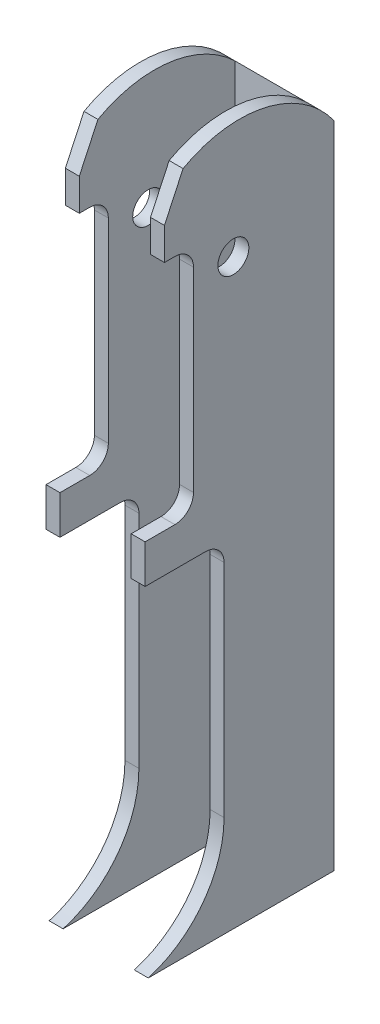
ISO-10303-21;
HEADER;
FILE_DESCRIPTION(('STEP AP214'),'2;1');
FILE_NAME('part.step','',(''),(''),'','','');
FILE_SCHEMA(('AUTOMOTIVE_DESIGN { 1 0 10303 214 1 1 1 1 }'));
ENDSEC;
DATA;
#1=APPLICATION_CONTEXT('core data for automotive mechanical design processes');
#2=APPLICATION_PROTOCOL_DEFINITION('international standard','automotive_design',2000,#1);
#3=PRODUCT_CONTEXT('',#1,'mechanical');
#4=PRODUCT('Part','Part','',(#3));
#5=PRODUCT_RELATED_PRODUCT_CATEGORY('part','',(#4));
#6=PRODUCT_DEFINITION_FORMATION('','',#4);
#7=PRODUCT_DEFINITION_CONTEXT('part definition',#1,'design');
#8=PRODUCT_DEFINITION('design','',#6,#7);
#9=PRODUCT_DEFINITION_SHAPE('','',#8);
#10=(LENGTH_UNIT() NAMED_UNIT(*) SI_UNIT(.MILLI.,.METRE.));
#11=(NAMED_UNIT(*) PLANE_ANGLE_UNIT() SI_UNIT($,.RADIAN.));
#12=(NAMED_UNIT(*) SI_UNIT($,.STERADIAN.) SOLID_ANGLE_UNIT());
#13=UNCERTAINTY_MEASURE_WITH_UNIT(LENGTH_MEASURE(1.E-05),#10,'distance_accuracy_value','');
#14=(GEOMETRIC_REPRESENTATION_CONTEXT(3) GLOBAL_UNCERTAINTY_ASSIGNED_CONTEXT((#13)) GLOBAL_UNIT_ASSIGNED_CONTEXT((#10,
#11,#12)) REPRESENTATION_CONTEXT('',''));
#15=CARTESIAN_POINT('',(0.,0.,0.));
#16=DIRECTION('',(0.,0.,1.));
#17=DIRECTION('',(1.,0.,0.));
#18=AXIS2_PLACEMENT_3D('',#15,#16,#17);
#19=CARTESIAN_POINT('',(0.,47.752,8.255));
#20=DIRECTION('',(-1.,0.,0.));
#21=DIRECTION('',(0.,0.,1.));
#22=AXIS2_PLACEMENT_3D('',#19,#20,#21);
#23=CYLINDRICAL_SURFACE('',#22,1.27);
#24=CARTESIAN_POINT('',(-1.143,47.752,8.255));
#25=DIRECTION('',(-1.,0.,0.));
#26=DIRECTION('',(0.,0.,1.));
#27=AXIS2_PLACEMENT_3D('',#24,#25,#26);
#28=CIRCLE('',#27,1.27);
#29=CARTESIAN_POINT('',(-1.143,47.752,9.525));
#30=VERTEX_POINT('',#29);
#31=EDGE_CURVE('E284',#30,#30,#28,.T.);
#32=ORIENTED_EDGE('',*,*,#31,.T.);
#33=EDGE_LOOP('',(#32));
#34=FACE_BOUND('',#33,.T.);
#35=CARTESIAN_POINT('',(0.,47.752,8.255));
#36=DIRECTION('',(-1.,0.,0.));
#37=DIRECTION('',(0.,0.,1.));
#38=AXIS2_PLACEMENT_3D('',#35,#36,#37);
#39=CIRCLE('',#38,1.27);
#40=CARTESIAN_POINT('',(0.,47.752,9.525));
#41=VERTEX_POINT('',#40);
#42=EDGE_CURVE('E542',#41,#41,#39,.T.);
#43=ORIENTED_EDGE('',*,*,#42,.F.);
#44=EDGE_LOOP('',(#43));
#45=FACE_BOUND('',#44,.T.);
#46=ADVANCED_FACE('F17',(#34,#45),#23,.F.);
#47=CARTESIAN_POINT('',(-8.128,50.165,13.9065));
#48=DIRECTION('',(0.,-1.,0.));
#49=DIRECTION('',(0.,0.,-1.));
#50=AXIS2_PLACEMENT_3D('',#47,#48,#49);
#51=PLANE('',#50);
#52=DIRECTION('',(0.,0.,-1.));
#53=VECTOR('',#52,1.);
#54=CARTESIAN_POINT('',(0.,50.165,7.747));
#55=LINE('',#54,#53);
#56=CARTESIAN_POINT('',(0.,50.165,13.9065));
#57=VERTEX_POINT('',#56);
#58=CARTESIAN_POINT('',(0.,50.165,13.04925));
#59=VERTEX_POINT('',#58);
#60=EDGE_CURVE('E212',#57,#59,#55,.T.);
#61=ORIENTED_EDGE('',*,*,#60,.F.);
#62=DIRECTION('',(1.,0.,0.));
#63=VECTOR('',#62,1.);
#64=CARTESIAN_POINT('',(-8.128,50.165,13.9065));
#65=LINE('',#64,#63);
#66=CARTESIAN_POINT('',(-1.143,50.165,13.9065));
#67=VERTEX_POINT('',#66);
#68=EDGE_CURVE('E248',#67,#57,#65,.T.);
#69=ORIENTED_EDGE('',*,*,#68,.F.);
#70=DIRECTION('',(0.,0.,-1.));
#71=VECTOR('',#70,1.);
#72=CARTESIAN_POINT('',(-1.143,50.165,7.747));
#73=LINE('',#72,#71);
#74=CARTESIAN_POINT('',(-1.143,50.165,13.04925));
#75=VERTEX_POINT('',#74);
#76=EDGE_CURVE('E281',#67,#75,#73,.T.);
#77=ORIENTED_EDGE('',*,*,#76,.T.);
#78=DIRECTION('',(-1.,0.,0.));
#79=VECTOR('',#78,1.);
#80=CARTESIAN_POINT('',(-8.128,50.165,13.04925));
#81=LINE('',#80,#79);
#82=EDGE_CURVE('E231',#75,#59,#81,.F.);
#83=ORIENTED_EDGE('',*,*,#82,.T.);
#84=EDGE_LOOP('',(#61,#69,#77,#83));
#85=FACE_BOUND('',#84,.T.);
#86=ADVANCED_FACE('F607',(#85),#51,.T.);
#87=CARTESIAN_POINT('',(-8.128,48.641,13.04925));
#88=DIRECTION('',(-1.,0.,0.));
#89=DIRECTION('',(0.,0.,1.));
#90=AXIS2_PLACEMENT_3D('',#87,#88,#89);
#91=CYLINDRICAL_SURFACE('',#90,1.524);
#92=DIRECTION('',(1.,0.,0.));
#93=VECTOR('',#92,1.);
#94=CARTESIAN_POINT('',(-8.128,48.641,11.52525));
#95=LINE('',#94,#93);
#96=CARTESIAN_POINT('',(0.,48.641,11.52525));
#97=VERTEX_POINT('',#96);
#98=CARTESIAN_POINT('',(-1.143,48.641,11.52525));
#99=VERTEX_POINT('',#98);
#100=EDGE_CURVE('E223',#97,#99,#95,.F.);
#101=ORIENTED_EDGE('',*,*,#100,.F.);
#102=CARTESIAN_POINT('',(0.,48.641,13.04925));
#103=DIRECTION('',(-1.,0.,0.));
#104=DIRECTION('',(0.,0.,1.));
#105=AXIS2_PLACEMENT_3D('',#102,#103,#104);
#106=CIRCLE('',#105,1.524);
#107=EDGE_CURVE('E21',#59,#97,#106,.T.);
#108=ORIENTED_EDGE('',*,*,#107,.F.);
#109=ORIENTED_EDGE('',*,*,#82,.F.);
#110=CARTESIAN_POINT('',(-1.143,48.641,13.04925));
#111=DIRECTION('',(-1.,0.,0.));
#112=DIRECTION('',(0.,0.,1.));
#113=AXIS2_PLACEMENT_3D('',#110,#111,#112);
#114=CIRCLE('',#113,1.524);
#115=EDGE_CURVE('E226',#75,#99,#114,.T.);
#116=ORIENTED_EDGE('',*,*,#115,.T.);
#117=EDGE_LOOP('',(#101,#108,#109,#116));
#118=FACE_BOUND('',#117,.T.);
#119=ADVANCED_FACE('F224',(#118),#91,.F.);
#120=CARTESIAN_POINT('',(-8.128,50.165,11.52525));
#121=DIRECTION('',(0.,0.,1.));
#122=DIRECTION('',(1.,0.,0.));
#123=AXIS2_PLACEMENT_3D('',#120,#121,#122);
#124=PLANE('',#123);
#125=DIRECTION('',(0.,1.,0.));
#126=VECTOR('',#125,1.);
#127=CARTESIAN_POINT('',(-1.143,47.752,11.52525));
#128=LINE('',#127,#126);
#129=CARTESIAN_POINT('',(-1.143,32.639,11.52525));
#130=VERTEX_POINT('',#129);
#131=EDGE_CURVE('E279',#99,#130,#128,.F.);
#132=ORIENTED_EDGE('',*,*,#131,.T.);
#133=DIRECTION('',(1.,0.,0.));
#134=VECTOR('',#133,1.);
#135=CARTESIAN_POINT('',(-8.128,32.639,11.52525));
#136=LINE('',#135,#134);
#137=CARTESIAN_POINT('',(0.,32.639,11.52525));
#138=VERTEX_POINT('',#137);
#139=EDGE_CURVE('E230',#130,#138,#136,.T.);
#140=ORIENTED_EDGE('',*,*,#139,.T.);
#141=DIRECTION('',(0.,1.,0.));
#142=VECTOR('',#141,1.);
#143=CARTESIAN_POINT('',(0.,47.752,11.52525));
#144=LINE('',#143,#142);
#145=EDGE_CURVE('E219',#97,#138,#144,.F.);
#146=ORIENTED_EDGE('',*,*,#145,.F.);
#147=ORIENTED_EDGE('',*,*,#100,.T.);
#148=EDGE_LOOP('',(#132,#140,#146,#147));
#149=FACE_BOUND('',#148,.T.);
#150=ADVANCED_FACE('F233',(#149),#124,.T.);
#151=CARTESIAN_POINT('',(-8.128,32.639,13.04925));
#152=DIRECTION('',(1.,0.,0.));
#153=DIRECTION('',(0.,0.,-1.));
#154=AXIS2_PLACEMENT_3D('',#151,#152,#153);
#155=CYLINDRICAL_SURFACE('',#154,1.524);
#156=DIRECTION('',(1.,0.,0.));
#157=VECTOR('',#156,1.);
#158=CARTESIAN_POINT('',(-8.128,31.115,13.04925));
#159=LINE('',#158,#157);
#160=CARTESIAN_POINT('',(-1.143,31.115,13.04925));
#161=VERTEX_POINT('',#160);
#162=CARTESIAN_POINT('',(0.,31.115,13.04925));
#163=VERTEX_POINT('',#162);
#164=EDGE_CURVE('E479',#161,#163,#159,.T.);
#165=ORIENTED_EDGE('',*,*,#164,.T.);
#166=CARTESIAN_POINT('',(0.,32.639,13.04925));
#167=DIRECTION('',(1.,0.,0.));
#168=DIRECTION('',(0.,0.,-1.));
#169=AXIS2_PLACEMENT_3D('',#166,#167,#168);
#170=CIRCLE('',#169,1.524);
#171=EDGE_CURVE('E235',#138,#163,#170,.F.);
#172=ORIENTED_EDGE('',*,*,#171,.F.);
#173=ORIENTED_EDGE('',*,*,#139,.F.);
#174=CARTESIAN_POINT('',(-1.143,32.639,13.04925));
#175=DIRECTION('',(1.,0.,0.));
#176=DIRECTION('',(0.,0.,-1.));
#177=AXIS2_PLACEMENT_3D('',#174,#175,#176);
#178=CIRCLE('',#177,1.524);
#179=EDGE_CURVE('E276',#130,#161,#178,.F.);
#180=ORIENTED_EDGE('',*,*,#179,.T.);
#181=EDGE_LOOP('',(#165,#172,#173,#180));
#182=FACE_BOUND('',#181,.T.);
#183=ADVANCED_FACE('F613',(#182),#155,.F.);
#184=CARTESIAN_POINT('',(-8.128,31.115,15.494));
#185=DIRECTION('',(0.,-1.,0.));
#186=DIRECTION('',(0.,0.,-1.));
#187=AXIS2_PLACEMENT_3D('',#184,#185,#186);
#188=PLANE('',#187);
#189=ORIENTED_EDGE('',*,*,#164,.F.);
#190=DIRECTION('',(0.,0.,-1.));
#191=VECTOR('',#190,1.);
#192=CARTESIAN_POINT('',(-1.143,31.115,7.747));
#193=LINE('',#192,#191);
#194=CARTESIAN_POINT('',(-1.143,31.115,15.494));
#195=VERTEX_POINT('',#194);
#196=EDGE_CURVE('E273',#161,#195,#193,.F.);
#197=ORIENTED_EDGE('',*,*,#196,.T.);
#198=DIRECTION('',(1.,0.,0.));
#199=VECTOR('',#198,1.);
#200=CARTESIAN_POINT('',(-8.128,31.115,15.494));
#201=LINE('',#200,#199);
#202=CARTESIAN_POINT('',(0.,31.115,15.494));
#203=VERTEX_POINT('',#202);
#204=EDGE_CURVE('E471',#203,#195,#201,.F.);
#205=ORIENTED_EDGE('',*,*,#204,.F.);
#206=DIRECTION('',(0.,0.,-1.));
#207=VECTOR('',#206,1.);
#208=CARTESIAN_POINT('',(0.,31.115,7.747));
#209=LINE('',#208,#207);
#210=EDGE_CURVE('E237',#163,#203,#209,.F.);
#211=ORIENTED_EDGE('',*,*,#210,.F.);
#212=EDGE_LOOP('',(#189,#197,#205,#211));
#213=FACE_BOUND('',#212,.T.);
#214=ADVANCED_FACE('F562',(#213),#188,.F.);
#215=CARTESIAN_POINT('',(-8.128,31.115,15.494));
#216=DIRECTION('',(0.,0.,1.));
#217=DIRECTION('',(1.,0.,0.));
#218=AXIS2_PLACEMENT_3D('',#215,#216,#217);
#219=PLANE('',#218);
#220=DIRECTION('',(1.,0.,0.));
#221=VECTOR('',#220,1.);
#222=CARTESIAN_POINT('',(-8.128,27.94,15.494));
#223=LINE('',#222,#221);
#224=CARTESIAN_POINT('',(0.,27.94,15.494));
#225=VERTEX_POINT('',#224);
#226=CARTESIAN_POINT('',(-1.143,27.94,15.494));
#227=VERTEX_POINT('',#226);
#228=EDGE_CURVE('E469',#225,#227,#223,.F.);
#229=ORIENTED_EDGE('',*,*,#228,.F.);
#230=DIRECTION('',(0.,1.,0.));
#231=VECTOR('',#230,1.);
#232=CARTESIAN_POINT('',(0.,47.752,15.494));
#233=LINE('',#232,#231);
#234=EDGE_CURVE('E489',#203,#225,#233,.F.);
#235=ORIENTED_EDGE('',*,*,#234,.F.);
#236=ORIENTED_EDGE('',*,*,#204,.T.);
#237=DIRECTION('',(0.,1.,0.));
#238=VECTOR('',#237,1.);
#239=CARTESIAN_POINT('',(-1.143,47.752,15.494));
#240=LINE('',#239,#238);
#241=EDGE_CURVE('E270',#195,#227,#240,.F.);
#242=ORIENTED_EDGE('',*,*,#241,.T.);
#243=EDGE_LOOP('',(#229,#235,#236,#242));
#244=FACE_BOUND('',#243,.T.);
#245=ADVANCED_FACE('F566',(#244),#219,.T.);
#246=CARTESIAN_POINT('',(-8.128,27.94,15.494));
#247=DIRECTION('',(0.,-1.,0.));
#248=DIRECTION('',(0.,0.,-1.));
#249=AXIS2_PLACEMENT_3D('',#246,#247,#248);
#250=PLANE('',#249);
#251=DIRECTION('',(0.,0.,-1.));
#252=VECTOR('',#251,1.);
#253=CARTESIAN_POINT('',(0.,27.94,7.747));
#254=LINE('',#253,#252);
#255=CARTESIAN_POINT('',(0.,27.94,10.541));
#256=VERTEX_POINT('',#255);
#257=EDGE_CURVE('E491',#225,#256,#254,.T.);
#258=ORIENTED_EDGE('',*,*,#257,.F.);
#259=ORIENTED_EDGE('',*,*,#228,.T.);
#260=DIRECTION('',(0.,0.,-1.));
#261=VECTOR('',#260,1.);
#262=CARTESIAN_POINT('',(-1.143,27.94,7.747));
#263=LINE('',#262,#261);
#264=CARTESIAN_POINT('',(-1.143,27.94,10.541));
#265=VERTEX_POINT('',#264);
#266=EDGE_CURVE('E267',#227,#265,#263,.T.);
#267=ORIENTED_EDGE('',*,*,#266,.T.);
#268=DIRECTION('',(-1.,0.,0.));
#269=VECTOR('',#268,1.);
#270=CARTESIAN_POINT('',(-8.128,27.94,10.541));
#271=LINE('',#270,#269);
#272=EDGE_CURVE('E466',#265,#256,#271,.F.);
#273=ORIENTED_EDGE('',*,*,#272,.T.);
#274=EDGE_LOOP('',(#258,#259,#267,#273));
#275=FACE_BOUND('',#274,.T.);
#276=ADVANCED_FACE('F569',(#275),#250,.T.);
#277=CARTESIAN_POINT('',(-8.128,26.416,10.541));
#278=DIRECTION('',(-1.,0.,0.));
#279=DIRECTION('',(0.,0.,1.));
#280=AXIS2_PLACEMENT_3D('',#277,#278,#279);
#281=CYLINDRICAL_SURFACE('',#280,1.524);
#282=DIRECTION('',(1.,0.,0.));
#283=VECTOR('',#282,1.);
#284=CARTESIAN_POINT('',(-8.128,26.416,9.017));
#285=LINE('',#284,#283);
#286=CARTESIAN_POINT('',(0.,26.416,9.017));
#287=VERTEX_POINT('',#286);
#288=CARTESIAN_POINT('',(-1.143,26.416,9.017));
#289=VERTEX_POINT('',#288);
#290=EDGE_CURVE('E464',#287,#289,#285,.F.);
#291=ORIENTED_EDGE('',*,*,#290,.F.);
#292=CARTESIAN_POINT('',(0.,26.416,10.541));
#293=DIRECTION('',(-1.,0.,0.));
#294=DIRECTION('',(0.,0.,1.));
#295=AXIS2_PLACEMENT_3D('',#292,#293,#294);
#296=CIRCLE('',#295,1.524);
#297=EDGE_CURVE('E549',#256,#287,#296,.T.);
#298=ORIENTED_EDGE('',*,*,#297,.F.);
#299=ORIENTED_EDGE('',*,*,#272,.F.);
#300=CARTESIAN_POINT('',(-1.143,26.416,10.541));
#301=DIRECTION('',(-1.,0.,0.));
#302=DIRECTION('',(0.,0.,1.));
#303=AXIS2_PLACEMENT_3D('',#300,#301,#302);
#304=CIRCLE('',#303,1.524);
#305=EDGE_CURVE('E266',#265,#289,#304,.T.);
#306=ORIENTED_EDGE('',*,*,#305,.T.);
#307=EDGE_LOOP('',(#291,#298,#299,#306));
#308=FACE_BOUND('',#307,.T.);
#309=ADVANCED_FACE('F572',(#308),#281,.F.);
#310=CARTESIAN_POINT('',(-8.128,27.94,9.017));
#311=DIRECTION('',(0.,0.,1.));
#312=DIRECTION('',(1.,0.,0.));
#313=AXIS2_PLACEMENT_3D('',#310,#311,#312);
#314=PLANE('',#313);
#315=DIRECTION('',(0.,1.,0.));
#316=VECTOR('',#315,1.);
#317=CARTESIAN_POINT('',(-1.143,47.752,9.017));
#318=LINE('',#317,#316);
#319=CARTESIAN_POINT('',(-1.143,8.29056,9.017));
#320=VERTEX_POINT('',#319);
#321=EDGE_CURVE('E263',#289,#320,#318,.F.);
#322=ORIENTED_EDGE('',*,*,#321,.T.);
#323=DIRECTION('',(1.,0.,0.));
#324=VECTOR('',#323,1.);
#325=CARTESIAN_POINT('',(-8.128,8.29056,9.017));
#326=LINE('',#325,#324);
#327=CARTESIAN_POINT('',(0.,8.29056,9.017));
#328=VERTEX_POINT('',#327);
#329=EDGE_CURVE('E461',#320,#328,#326,.T.);
#330=ORIENTED_EDGE('',*,*,#329,.T.);
#331=DIRECTION('',(0.,1.,0.));
#332=VECTOR('',#331,1.);
#333=CARTESIAN_POINT('',(0.,47.752,9.017));
#334=LINE('',#333,#332);
#335=EDGE_CURVE('E548',#287,#328,#334,.F.);
#336=ORIENTED_EDGE('',*,*,#335,.F.);
#337=ORIENTED_EDGE('',*,*,#290,.T.);
#338=EDGE_LOOP('',(#322,#330,#336,#337));
#339=FACE_BOUND('',#338,.T.);
#340=ADVANCED_FACE('F576',(#339),#314,.T.);
#341=CARTESIAN_POINT('',(-8.128,8.29056,17.653));
#342=DIRECTION('',(1.,0.,0.));
#343=DIRECTION('',(0.,0.,-1.));
#344=AXIS2_PLACEMENT_3D('',#341,#342,#343);
#345=CYLINDRICAL_SURFACE('',#344,8.636);
#346=DIRECTION('',(1.,0.,0.));
#347=VECTOR('',#346,1.);
#348=CARTESIAN_POINT('',(-8.128,0.,15.23492));
#349=LINE('',#348,#347);
#350=CARTESIAN_POINT('',(0.,0.,15.23492));
#351=VERTEX_POINT('',#350);
#352=CARTESIAN_POINT('',(-1.143,0.,15.23492));
#353=VERTEX_POINT('',#352);
#354=EDGE_CURVE('E452',#351,#353,#349,.F.);
#355=ORIENTED_EDGE('',*,*,#354,.F.);
#356=CARTESIAN_POINT('',(0.,8.29056,17.653));
#357=DIRECTION('',(1.,0.,0.));
#358=DIRECTION('',(0.,0.,-1.));
#359=AXIS2_PLACEMENT_3D('',#356,#357,#358);
#360=CIRCLE('',#359,8.636);
#361=EDGE_CURVE('E545',#328,#351,#360,.F.);
#362=ORIENTED_EDGE('',*,*,#361,.F.);
#363=ORIENTED_EDGE('',*,*,#329,.F.);
#364=CARTESIAN_POINT('',(-1.143,8.29056,17.653));
#365=DIRECTION('',(1.,0.,0.));
#366=DIRECTION('',(0.,0.,-1.));
#367=AXIS2_PLACEMENT_3D('',#364,#365,#366);
#368=CIRCLE('',#367,8.636);
#369=EDGE_CURVE('E260',#320,#353,#368,.F.);
#370=ORIENTED_EDGE('',*,*,#369,.T.);
#371=EDGE_LOOP('',(#355,#362,#363,#370));
#372=FACE_BOUND('',#371,.T.);
#373=ADVANCED_FACE('F713',(#372),#345,.F.);
#374=CARTESIAN_POINT('',(0.,52.8002499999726,13.9065000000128));
#375=DIRECTION('',(0.,-0.422618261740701,-0.906307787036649));
#376=DIRECTION('',(0.,0.906307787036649,-0.422618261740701));
#377=AXIS2_PLACEMENT_3D('',#374,#375,#376);
#378=PLANE('',#377);
#379=DIRECTION('',(0.,-0.906307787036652,0.422618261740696));
#380=VECTOR('',#379,1.);
#381=CARTESIAN_POINT('',(0.,56.0744823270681,12.3797003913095));
#382=LINE('',#381,#380);
#383=CARTESIAN_POINT('',(0.,56.0744823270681,12.3797003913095));
#384=VERTEX_POINT('',#383);
#385=CARTESIAN_POINT('',(0.,52.80025,13.9065));
#386=VERTEX_POINT('',#385);
#387=EDGE_CURVE('E246',#384,#386,#382,.T.);
#388=ORIENTED_EDGE('',*,*,#387,.F.);
#389=DIRECTION('',(1.,0.,0.));
#390=VECTOR('',#389,1.);
#391=CARTESIAN_POINT('',(0.,56.0744823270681,12.3797003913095));
#392=LINE('',#391,#390);
#393=CARTESIAN_POINT('',(-1.143,56.0744823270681,12.3797003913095));
#394=VERTEX_POINT('',#393);
#395=EDGE_CURVE('E449',#394,#384,#392,.T.);
#396=ORIENTED_EDGE('',*,*,#395,.F.);
#397=DIRECTION('',(0.,-0.906307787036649,0.422618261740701));
#398=VECTOR('',#397,1.);
#399=CARTESIAN_POINT('',(-1.143,56.0744823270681,12.3797003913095));
#400=LINE('',#399,#398);
#401=CARTESIAN_POINT('',(-1.143,52.80025,13.9065));
#402=VERTEX_POINT('',#401);
#403=EDGE_CURVE('E251',#394,#402,#400,.T.);
#404=ORIENTED_EDGE('',*,*,#403,.T.);
#405=DIRECTION('',(1.,0.,0.));
#406=VECTOR('',#405,1.);
#407=CARTESIAN_POINT('',(-8.128,52.80025,13.9065));
#408=LINE('',#407,#406);
#409=EDGE_CURVE('E451',#386,#402,#408,.F.);
#410=ORIENTED_EDGE('',*,*,#409,.F.);
#411=EDGE_LOOP('',(#388,#396,#404,#410));
#412=FACE_BOUND('',#411,.T.);
#413=ADVANCED_FACE('F600',(#412),#378,.F.);
#414=CARTESIAN_POINT('',(-8.128,55.0174101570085,13.9065));
#415=DIRECTION('',(0.,0.,1.));
#416=DIRECTION('',(1.,0.,0.));
#417=AXIS2_PLACEMENT_3D('',#414,#415,#416);
#418=PLANE('',#417);
#419=ORIENTED_EDGE('',*,*,#68,.T.);
#420=DIRECTION('',(0.,1.,0.));
#421=VECTOR('',#420,1.);
#422=CARTESIAN_POINT('',(0.,47.752,13.9065));
#423=LINE('',#422,#421);
#424=EDGE_CURVE('E243',#386,#57,#423,.F.);
#425=ORIENTED_EDGE('',*,*,#424,.F.);
#426=ORIENTED_EDGE('',*,*,#409,.T.);
#427=DIRECTION('',(0.,1.,0.));
#428=VECTOR('',#427,1.);
#429=CARTESIAN_POINT('',(-1.143,47.752,13.9065));
#430=LINE('',#429,#428);
#431=EDGE_CURVE('E254',#402,#67,#430,.F.);
#432=ORIENTED_EDGE('',*,*,#431,.T.);
#433=EDGE_LOOP('',(#419,#425,#426,#432));
#434=FACE_BOUND('',#433,.T.);
#435=ADVANCED_FACE('F604',(#434),#418,.T.);
#436=CARTESIAN_POINT('',(-4.064,46.0375,0.));
#437=DIRECTION('',(0.,0.,1.));
#438=DIRECTION('',(1.,0.,0.));
#439=AXIS2_PLACEMENT_3D('',#436,#437,#438);
#440=CYLINDRICAL_SURFACE('',#439,1.27);
#441=CARTESIAN_POINT('',(-4.064,46.0375,0.));
#442=DIRECTION('',(0.,0.,1.));
#443=DIRECTION('',(1.,0.,0.));
#444=AXIS2_PLACEMENT_3D('',#441,#442,#443);
#445=CIRCLE('',#444,1.27);
#446=CARTESIAN_POINT('',(-2.794,46.0375,0.));
#447=VERTEX_POINT('',#446);
#448=EDGE_CURVE('E422',#447,#447,#445,.F.);
#449=ORIENTED_EDGE('',*,*,#448,.T.);
#450=EDGE_LOOP('',(#449));
#451=FACE_BOUND('',#450,.T.);
#452=CARTESIAN_POINT('',(-4.064,46.0375,1.143));
#453=DIRECTION('',(0.,0.,1.));
#454=DIRECTION('',(1.,0.,0.));
#455=AXIS2_PLACEMENT_3D('',#452,#453,#454);
#456=CIRCLE('',#455,1.27);
#457=CARTESIAN_POINT('',(-2.794,46.0375,1.143));
#458=VERTEX_POINT('',#457);
#459=EDGE_CURVE('E539',#458,#458,#456,.F.);
#460=ORIENTED_EDGE('',*,*,#459,.F.);
#461=EDGE_LOOP('',(#460));
#462=FACE_BOUND('',#461,.T.);
#463=ADVANCED_FACE('F704',(#451,#462),#440,.F.);
#464=CARTESIAN_POINT('',(-4.064,11.1125,0.));
#465=DIRECTION('',(0.,0.,1.));
#466=DIRECTION('',(1.,0.,0.));
#467=AXIS2_PLACEMENT_3D('',#464,#465,#466);
#468=CYLINDRICAL_SURFACE('',#467,1.27);
#469=CARTESIAN_POINT('',(-4.064,11.1125,0.));
#470=DIRECTION('',(0.,0.,1.));
#471=DIRECTION('',(1.,0.,0.));
#472=AXIS2_PLACEMENT_3D('',#469,#470,#471);
#473=CIRCLE('',#472,1.27);
#474=CARTESIAN_POINT('',(-2.794,11.1125,0.));
#475=VERTEX_POINT('',#474);
#476=EDGE_CURVE('E353',#475,#475,#473,.F.);
#477=ORIENTED_EDGE('',*,*,#476,.T.);
#478=EDGE_LOOP('',(#477));
#479=FACE_BOUND('',#478,.T.);
#480=CARTESIAN_POINT('',(-4.064,11.1125,1.143));
#481=DIRECTION('',(0.,0.,1.));
#482=DIRECTION('',(1.,0.,0.));
#483=AXIS2_PLACEMENT_3D('',#480,#481,#482);
#484=CIRCLE('',#483,1.27);
#485=CARTESIAN_POINT('',(-2.794,11.1125,1.143));
#486=VERTEX_POINT('',#485);
#487=EDGE_CURVE('E536',#486,#486,#484,.F.);
#488=ORIENTED_EDGE('',*,*,#487,.F.);
#489=EDGE_LOOP('',(#488));
#490=FACE_BOUND('',#489,.T.);
#491=ADVANCED_FACE('F700',(#479,#490),#468,.F.);
#492=CARTESIAN_POINT('',(0.,47.752,7.747));
#493=DIRECTION('',(1.,0.,0.));
#494=DIRECTION('',(0.,0.,-1.));
#495=AXIS2_PLACEMENT_3D('',#492,#493,#494);
#496=PLANE('',#495);
#497=ORIENTED_EDGE('',*,*,#42,.T.);
#498=EDGE_LOOP('',(#497));
#499=FACE_BOUND('',#498,.T.);
#500=DIRECTION('',(0.,1.,0.));
#501=VECTOR('',#500,1.);
#502=CARTESIAN_POINT('',(0.,53.2936257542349,0.));
#503=LINE('',#502,#501);
#504=CARTESIAN_POINT('',(0.,0.,0.));
#505=VERTEX_POINT('',#504);
#506=CARTESIAN_POINT('',(0.,53.2936257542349,0.));
#507=VERTEX_POINT('',#506);
#508=EDGE_CURVE('E352',#505,#507,#503,.T.);
#509=ORIENTED_EDGE('',*,*,#508,.T.);
#510=CARTESIAN_POINT('',(0.,47.752,7.747));
#511=DIRECTION('',(1.,0.,0.));
#512=DIRECTION('',(0.,0.,-1.));
#513=AXIS2_PLACEMENT_3D('',#510,#511,#512);
#514=CIRCLE('',#513,9.525);
#515=EDGE_CURVE('E348',#384,#507,#514,.F.);
#516=ORIENTED_EDGE('',*,*,#515,.F.);
#517=ORIENTED_EDGE('',*,*,#387,.T.);
#518=ORIENTED_EDGE('',*,*,#424,.T.);
#519=ORIENTED_EDGE('',*,*,#60,.T.);
#520=ORIENTED_EDGE('',*,*,#107,.T.);
#521=ORIENTED_EDGE('',*,*,#145,.T.);
#522=ORIENTED_EDGE('',*,*,#171,.T.);
#523=ORIENTED_EDGE('',*,*,#210,.T.);
#524=ORIENTED_EDGE('',*,*,#234,.T.);
#525=ORIENTED_EDGE('',*,*,#257,.T.);
#526=ORIENTED_EDGE('',*,*,#297,.T.);
#527=ORIENTED_EDGE('',*,*,#335,.T.);
#528=ORIENTED_EDGE('',*,*,#361,.T.);
#529=DIRECTION('',(0.,0.,-1.));
#530=VECTOR('',#529,1.);
#531=CARTESIAN_POINT('',(0.,0.,15.23492));
#532=LINE('',#531,#530);
#533=EDGE_CURVE('E358',#505,#351,#532,.F.);
#534=ORIENTED_EDGE('',*,*,#533,.F.);
#535=EDGE_LOOP('',(#509,#516,#517,#518,#519,#520,#521,#522,#523,#524,#525,#526,#527,#528,#534));
#536=FACE_BOUND('',#535,.T.);
#537=ADVANCED_FACE('F217',(#499,#536),#496,.T.);
#538=CARTESIAN_POINT('',(-8.128,53.2936257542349,1.143));
#539=DIRECTION('',(0.,0.,1.));
#540=DIRECTION('',(1.,0.,0.));
#541=AXIS2_PLACEMENT_3D('',#538,#539,#540);
#542=PLANE('',#541);
#543=DIRECTION('',(1.,0.,0.));
#544=VECTOR('',#543,1.);
#545=CARTESIAN_POINT('',(-8.128,0.,1.143));
#546=LINE('',#545,#544);
#547=CARTESIAN_POINT('',(-1.143,0.,1.143));
#548=VERTEX_POINT('',#547);
#549=CARTESIAN_POINT('',(-6.985,0.,1.143));
#550=VERTEX_POINT('',#549);
#551=EDGE_CURVE('E426',#548,#550,#546,.F.);
#552=ORIENTED_EDGE('',*,*,#551,.F.);
#553=DIRECTION('',(0.,1.,0.));
#554=VECTOR('',#553,1.);
#555=CARTESIAN_POINT('',(-1.143,47.752,1.143));
#556=LINE('',#555,#554);
#557=CARTESIAN_POINT('',(-1.143,54.6158771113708,1.143));
#558=VERTEX_POINT('',#557);
#559=EDGE_CURVE('E255',#548,#558,#556,.T.);
#560=ORIENTED_EDGE('',*,*,#559,.T.);
#561=DIRECTION('',(1.,0.,0.));
#562=VECTOR('',#561,1.);
#563=CARTESIAN_POINT('',(-8.128,54.6158771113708,1.143));
#564=LINE('',#563,#562);
#565=CARTESIAN_POINT('',(-6.985,54.6158771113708,1.143));
#566=VERTEX_POINT('',#565);
#567=EDGE_CURVE('E415',#566,#558,#564,.T.);
#568=ORIENTED_EDGE('',*,*,#567,.F.);
#569=DIRECTION('',(0.,1.,0.));
#570=VECTOR('',#569,1.);
#571=CARTESIAN_POINT('',(-6.985,47.752,1.143));
#572=LINE('',#571,#570);
#573=EDGE_CURVE('E287',#550,#566,#572,.T.);
#574=ORIENTED_EDGE('',*,*,#573,.F.);
#575=EDGE_LOOP('',(#552,#560,#568,#574));
#576=FACE_BOUND('',#575,.T.);
#577=ORIENTED_EDGE('',*,*,#487,.T.);
#578=EDGE_LOOP('',(#577));
#579=FACE_BOUND('',#578,.T.);
#580=ORIENTED_EDGE('',*,*,#459,.T.);
#581=EDGE_LOOP('',(#580));
#582=FACE_BOUND('',#581,.T.);
#583=ADVANCED_FACE('F694',(#576,#579,#582),#542,.T.);
#584=CARTESIAN_POINT('',(-1.143,47.752,7.747));
#585=DIRECTION('',(1.,0.,0.));
#586=DIRECTION('',(0.,0.,-1.));
#587=AXIS2_PLACEMENT_3D('',#584,#585,#586);
#588=PLANE('',#587);
#589=ORIENTED_EDGE('',*,*,#403,.F.);
#590=CARTESIAN_POINT('',(-1.143,47.752,7.747));
#591=DIRECTION('',(1.,0.,0.));
#592=DIRECTION('',(0.,0.,-1.));
#593=AXIS2_PLACEMENT_3D('',#590,#591,#592);
#594=CIRCLE('',#593,9.525);
#595=EDGE_CURVE('E337',#558,#394,#594,.T.);
#596=ORIENTED_EDGE('',*,*,#595,.F.);
#597=ORIENTED_EDGE('',*,*,#559,.F.);
#598=DIRECTION('',(0.,0.,-1.));
#599=VECTOR('',#598,1.);
#600=CARTESIAN_POINT('',(-1.143,0.,15.23492));
#601=LINE('',#600,#599);
#602=EDGE_CURVE('E430',#353,#548,#601,.T.);
#603=ORIENTED_EDGE('',*,*,#602,.F.);
#604=ORIENTED_EDGE('',*,*,#369,.F.);
#605=ORIENTED_EDGE('',*,*,#321,.F.);
#606=ORIENTED_EDGE('',*,*,#305,.F.);
#607=ORIENTED_EDGE('',*,*,#266,.F.);
#608=ORIENTED_EDGE('',*,*,#241,.F.);
#609=ORIENTED_EDGE('',*,*,#196,.F.);
#610=ORIENTED_EDGE('',*,*,#179,.F.);
#611=ORIENTED_EDGE('',*,*,#131,.F.);
#612=ORIENTED_EDGE('',*,*,#115,.F.);
#613=ORIENTED_EDGE('',*,*,#76,.F.);
#614=ORIENTED_EDGE('',*,*,#431,.F.);
#615=EDGE_LOOP('',(#589,#596,#597,#603,#604,#605,#606,#607,#608,#609,#610,#611,#612,#613,#614));
#616=FACE_BOUND('',#615,.T.);
#617=ORIENTED_EDGE('',*,*,#31,.F.);
#618=EDGE_LOOP('',(#617));
#619=FACE_BOUND('',#618,.T.);
#620=ADVANCED_FACE('F609',(#616,#619),#588,.F.);
#621=CARTESIAN_POINT('',(-6.985,47.752,7.747));
#622=DIRECTION('',(1.,0.,0.));
#623=DIRECTION('',(0.,0.,-1.));
#624=AXIS2_PLACEMENT_3D('',#621,#622,#623);
#625=PLANE('',#624);
#626=CARTESIAN_POINT('',(-6.985,47.752,8.255));
#627=DIRECTION('',(-1.,0.,0.));
#628=DIRECTION('',(0.,0.,1.));
#629=AXIS2_PLACEMENT_3D('',#626,#627,#628);
#630=CIRCLE('',#629,1.27);
#631=CARTESIAN_POINT('',(-6.985,47.752,9.525));
#632=VERTEX_POINT('',#631);
#633=EDGE_CURVE('E289',#632,#632,#630,.T.);
#634=ORIENTED_EDGE('',*,*,#633,.T.);
#635=EDGE_LOOP('',(#634));
#636=FACE_BOUND('',#635,.T.);
#637=ORIENTED_EDGE('',*,*,#573,.T.);
#638=CARTESIAN_POINT('',(-6.985,47.752,7.747));
#639=DIRECTION('',(1.,0.,0.));
#640=DIRECTION('',(0.,0.,-1.));
#641=AXIS2_PLACEMENT_3D('',#638,#639,#640);
#642=CIRCLE('',#641,9.525);
#643=CARTESIAN_POINT('',(-6.985,56.0744823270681,12.3797003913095));
#644=VERTEX_POINT('',#643);
#645=EDGE_CURVE('E347',#644,#566,#642,.F.);
#646=ORIENTED_EDGE('',*,*,#645,.F.);
#647=DIRECTION('',(0.,0.906307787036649,-0.422618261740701));
#648=VECTOR('',#647,1.);
#649=CARTESIAN_POINT('',(-6.985,52.8002499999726,13.9065000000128));
#650=LINE('',#649,#648);
#651=CARTESIAN_POINT('',(-6.985,52.80025,13.9065));
#652=VERTEX_POINT('',#651);
#653=EDGE_CURVE('E336',#644,#652,#650,.F.);
#654=ORIENTED_EDGE('',*,*,#653,.T.);
#655=DIRECTION('',(0.,1.,0.));
#656=VECTOR('',#655,1.);
#657=CARTESIAN_POINT('',(-6.985,55.0174101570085,13.9065));
#658=LINE('',#657,#656);
#659=CARTESIAN_POINT('',(-6.985,50.165,13.9065));
#660=VERTEX_POINT('',#659);
#661=EDGE_CURVE('E403',#660,#652,#658,.T.);
#662=ORIENTED_EDGE('',*,*,#661,.F.);
#663=DIRECTION('',(0.,0.,-1.));
#664=VECTOR('',#663,1.);
#665=CARTESIAN_POINT('',(-6.985,50.165,13.9065));
#666=LINE('',#665,#664);
#667=CARTESIAN_POINT('',(-6.985,50.165,13.04925));
#668=VERTEX_POINT('',#667);
#669=EDGE_CURVE('E400',#668,#660,#666,.F.);
#670=ORIENTED_EDGE('',*,*,#669,.F.);
#671=CARTESIAN_POINT('',(-6.985,48.641,13.04925));
#672=DIRECTION('',(-1.,0.,0.));
#673=DIRECTION('',(0.,0.,1.));
#674=AXIS2_PLACEMENT_3D('',#671,#672,#673);
#675=CIRCLE('',#674,1.524);
#676=CARTESIAN_POINT('',(-6.985,48.641,11.52525));
#677=VERTEX_POINT('',#676);
#678=EDGE_CURVE('E399',#668,#677,#675,.T.);
#679=ORIENTED_EDGE('',*,*,#678,.T.);
#680=DIRECTION('',(0.,1.,0.));
#681=VECTOR('',#680,1.);
#682=CARTESIAN_POINT('',(-6.985,50.165,11.52525));
#683=LINE('',#682,#681);
#684=CARTESIAN_POINT('',(-6.985,32.639,11.52525));
#685=VERTEX_POINT('',#684);
#686=EDGE_CURVE('E395',#685,#677,#683,.T.);
#687=ORIENTED_EDGE('',*,*,#686,.F.);
#688=CARTESIAN_POINT('',(-6.985,32.639,13.04925));
#689=DIRECTION('',(1.,0.,0.));
#690=DIRECTION('',(0.,0.,-1.));
#691=AXIS2_PLACEMENT_3D('',#688,#689,#690);
#692=CIRCLE('',#691,1.524);
#693=CARTESIAN_POINT('',(-6.985,31.115,13.04925));
#694=VERTEX_POINT('',#693);
#695=EDGE_CURVE('E389',#685,#694,#692,.F.);
#696=ORIENTED_EDGE('',*,*,#695,.T.);
#697=DIRECTION('',(0.,0.,-1.));
#698=VECTOR('',#697,1.);
#699=CARTESIAN_POINT('',(-6.985,31.115,15.494));
#700=LINE('',#699,#698);
#701=CARTESIAN_POINT('',(-6.985,31.115,15.494));
#702=VERTEX_POINT('',#701);
#703=EDGE_CURVE('E388',#694,#702,#700,.F.);
#704=ORIENTED_EDGE('',*,*,#703,.T.);
#705=DIRECTION('',(0.,1.,0.));
#706=VECTOR('',#705,1.);
#707=CARTESIAN_POINT('',(-6.985,31.115,15.494));
#708=LINE('',#707,#706);
#709=CARTESIAN_POINT('',(-6.985,27.94,15.494));
#710=VERTEX_POINT('',#709);
#711=EDGE_CURVE('E382',#710,#702,#708,.T.);
#712=ORIENTED_EDGE('',*,*,#711,.F.);
#713=DIRECTION('',(0.,0.,-1.));
#714=VECTOR('',#713,1.);
#715=CARTESIAN_POINT('',(-6.985,27.94,15.494));
#716=LINE('',#715,#714);
#717=CARTESIAN_POINT('',(-6.985,27.94,10.541));
#718=VERTEX_POINT('',#717);
#719=EDGE_CURVE('E373',#718,#710,#716,.F.);
#720=ORIENTED_EDGE('',*,*,#719,.F.);
#721=CARTESIAN_POINT('',(-6.985,26.416,10.541));
#722=DIRECTION('',(-1.,0.,0.));
#723=DIRECTION('',(0.,0.,1.));
#724=AXIS2_PLACEMENT_3D('',#721,#722,#723);
#725=CIRCLE('',#724,1.524);
#726=CARTESIAN_POINT('',(-6.985,26.416,9.017));
#727=VERTEX_POINT('',#726);
#728=EDGE_CURVE('E370',#718,#727,#725,.T.);
#729=ORIENTED_EDGE('',*,*,#728,.T.);
#730=DIRECTION('',(0.,1.,0.));
#731=VECTOR('',#730,1.);
#732=CARTESIAN_POINT('',(-6.985,27.94,9.017));
#733=LINE('',#732,#731);
#734=CARTESIAN_POINT('',(-6.985,8.29056,9.017));
#735=VERTEX_POINT('',#734);
#736=EDGE_CURVE('E366',#735,#727,#733,.T.);
#737=ORIENTED_EDGE('',*,*,#736,.F.);
#738=CARTESIAN_POINT('',(-6.985,8.29056,17.653));
#739=DIRECTION('',(1.,0.,0.));
#740=DIRECTION('',(0.,0.,-1.));
#741=AXIS2_PLACEMENT_3D('',#738,#739,#740);
#742=CIRCLE('',#741,8.636);
#743=CARTESIAN_POINT('',(-6.985,0.,15.23492));
#744=VERTEX_POINT('',#743);
#745=EDGE_CURVE('E363',#735,#744,#742,.F.);
#746=ORIENTED_EDGE('',*,*,#745,.T.);
#747=DIRECTION('',(0.,0.,-1.));
#748=VECTOR('',#747,1.);
#749=CARTESIAN_POINT('',(-6.985,0.,15.23492));
#750=LINE('',#749,#748);
#751=EDGE_CURVE('E359',#550,#744,#750,.F.);
#752=ORIENTED_EDGE('',*,*,#751,.F.);
#753=EDGE_LOOP('',(#637,#646,#654,#662,#670,#679,#687,#696,#704,#712,#720,#729,#737,#746,#752));
#754=FACE_BOUND('',#753,.T.);
#755=ADVANCED_FACE('F687',(#636,#754),#625,.T.);
#756=CARTESIAN_POINT('',(0.,47.752,8.255));
#757=DIRECTION('',(-1.,0.,0.));
#758=DIRECTION('',(0.,0.,1.));
#759=AXIS2_PLACEMENT_3D('',#756,#757,#758);
#760=CYLINDRICAL_SURFACE('',#759,1.27);
#761=CARTESIAN_POINT('',(-8.128,47.752,8.255));
#762=DIRECTION('',(-1.,0.,0.));
#763=DIRECTION('',(0.,0.,1.));
#764=AXIS2_PLACEMENT_3D('',#761,#762,#763);
#765=CIRCLE('',#764,1.27);
#766=CARTESIAN_POINT('',(-8.128,47.752,9.525));
#767=VERTEX_POINT('',#766);
#768=EDGE_CURVE('E331',#767,#767,#765,.T.);
#769=ORIENTED_EDGE('',*,*,#768,.T.);
#770=EDGE_LOOP('',(#769));
#771=FACE_BOUND('',#770,.T.);
#772=ORIENTED_EDGE('',*,*,#633,.F.);
#773=EDGE_LOOP('',(#772));
#774=FACE_BOUND('',#773,.T.);
#775=ADVANCED_FACE('F683',(#771,#774),#760,.F.);
#776=CARTESIAN_POINT('',(-8.128,50.165,13.9065));
#777=DIRECTION('',(0.,-1.,0.));
#778=DIRECTION('',(0.,0.,-1.));
#779=AXIS2_PLACEMENT_3D('',#776,#777,#778);
#780=PLANE('',#779);
#781=ORIENTED_EDGE('',*,*,#669,.T.);
#782=DIRECTION('',(1.,0.,0.));
#783=VECTOR('',#782,1.);
#784=CARTESIAN_POINT('',(-8.128,50.165,13.9065));
#785=LINE('',#784,#783);
#786=CARTESIAN_POINT('',(-8.128,50.165,13.9065));
#787=VERTEX_POINT('',#786);
#788=EDGE_CURVE('E342',#787,#660,#785,.T.);
#789=ORIENTED_EDGE('',*,*,#788,.F.);
#790=DIRECTION('',(0.,0.,-1.));
#791=VECTOR('',#790,1.);
#792=CARTESIAN_POINT('',(-8.128,50.165,7.747));
#793=LINE('',#792,#791);
#794=CARTESIAN_POINT('',(-8.128,50.165,13.04925));
#795=VERTEX_POINT('',#794);
#796=EDGE_CURVE('E328',#787,#795,#793,.T.);
#797=ORIENTED_EDGE('',*,*,#796,.T.);
#798=DIRECTION('',(-1.,0.,0.));
#799=VECTOR('',#798,1.);
#800=CARTESIAN_POINT('',(-8.128,50.165,13.04925));
#801=LINE('',#800,#799);
#802=EDGE_CURVE('E396',#795,#668,#801,.F.);
#803=ORIENTED_EDGE('',*,*,#802,.T.);
#804=EDGE_LOOP('',(#781,#789,#797,#803));
#805=FACE_BOUND('',#804,.T.);
#806=ADVANCED_FACE('F679',(#805),#780,.T.);
#807=CARTESIAN_POINT('',(-8.128,48.641,13.04925));
#808=DIRECTION('',(-1.,0.,0.));
#809=DIRECTION('',(0.,0.,1.));
#810=AXIS2_PLACEMENT_3D('',#807,#808,#809);
#811=CYLINDRICAL_SURFACE('',#810,1.524);
#812=DIRECTION('',(1.,0.,0.));
#813=VECTOR('',#812,1.);
#814=CARTESIAN_POINT('',(-8.128,48.641,11.52525));
#815=LINE('',#814,#813);
#816=CARTESIAN_POINT('',(-8.128,48.641,11.52525));
#817=VERTEX_POINT('',#816);
#818=EDGE_CURVE('E393',#677,#817,#815,.F.);
#819=ORIENTED_EDGE('',*,*,#818,.F.);
#820=ORIENTED_EDGE('',*,*,#678,.F.);
#821=ORIENTED_EDGE('',*,*,#802,.F.);
#822=CARTESIAN_POINT('',(-8.128,48.641,13.04925));
#823=DIRECTION('',(-1.,0.,0.));
#824=DIRECTION('',(0.,0.,1.));
#825=AXIS2_PLACEMENT_3D('',#822,#823,#824);
#826=CIRCLE('',#825,1.524);
#827=EDGE_CURVE('E327',#795,#817,#826,.T.);
#828=ORIENTED_EDGE('',*,*,#827,.T.);
#829=EDGE_LOOP('',(#819,#820,#821,#828));
#830=FACE_BOUND('',#829,.T.);
#831=ADVANCED_FACE('F675',(#830),#811,.F.);
#832=CARTESIAN_POINT('',(-8.128,50.165,11.52525));
#833=DIRECTION('',(0.,0.,1.));
#834=DIRECTION('',(1.,0.,0.));
#835=AXIS2_PLACEMENT_3D('',#832,#833,#834);
#836=PLANE('',#835);
#837=DIRECTION('',(0.,1.,0.));
#838=VECTOR('',#837,1.);
#839=CARTESIAN_POINT('',(-8.128,47.752,11.52525));
#840=LINE('',#839,#838);
#841=CARTESIAN_POINT('',(-8.128,32.639,11.52525));
#842=VERTEX_POINT('',#841);
#843=EDGE_CURVE('E324',#817,#842,#840,.F.);
#844=ORIENTED_EDGE('',*,*,#843,.T.);
#845=DIRECTION('',(1.,0.,0.));
#846=VECTOR('',#845,1.);
#847=CARTESIAN_POINT('',(-8.128,32.639,11.52525));
#848=LINE('',#847,#846);
#849=EDGE_CURVE('E390',#842,#685,#848,.T.);
#850=ORIENTED_EDGE('',*,*,#849,.T.);
#851=ORIENTED_EDGE('',*,*,#686,.T.);
#852=ORIENTED_EDGE('',*,*,#818,.T.);
#853=EDGE_LOOP('',(#844,#850,#851,#852));
#854=FACE_BOUND('',#853,.T.);
#855=ADVANCED_FACE('F671',(#854),#836,.T.);
#856=CARTESIAN_POINT('',(-8.128,32.639,13.04925));
#857=DIRECTION('',(1.,0.,0.));
#858=DIRECTION('',(0.,0.,-1.));
#859=AXIS2_PLACEMENT_3D('',#856,#857,#858);
#860=CYLINDRICAL_SURFACE('',#859,1.524);
#861=DIRECTION('',(1.,0.,0.));
#862=VECTOR('',#861,1.);
#863=CARTESIAN_POINT('',(-8.128,31.115,13.04925));
#864=LINE('',#863,#862);
#865=CARTESIAN_POINT('',(-8.128,31.115,13.04925));
#866=VERTEX_POINT('',#865);
#867=EDGE_CURVE('E385',#866,#694,#864,.T.);
#868=ORIENTED_EDGE('',*,*,#867,.T.);
#869=ORIENTED_EDGE('',*,*,#695,.F.);
#870=ORIENTED_EDGE('',*,*,#849,.F.);
#871=CARTESIAN_POINT('',(-8.128,32.639,13.04925));
#872=DIRECTION('',(1.,0.,0.));
#873=DIRECTION('',(0.,0.,-1.));
#874=AXIS2_PLACEMENT_3D('',#871,#872,#873);
#875=CIRCLE('',#874,1.524);
#876=EDGE_CURVE('E321',#842,#866,#875,.F.);
#877=ORIENTED_EDGE('',*,*,#876,.T.);
#878=EDGE_LOOP('',(#868,#869,#870,#877));
#879=FACE_BOUND('',#878,.T.);
#880=ADVANCED_FACE('F667',(#879),#860,.F.);
#881=CARTESIAN_POINT('',(-8.128,31.115,15.494));
#882=DIRECTION('',(0.,-1.,0.));
#883=DIRECTION('',(0.,0.,-1.));
#884=AXIS2_PLACEMENT_3D('',#881,#882,#883);
#885=PLANE('',#884);
#886=ORIENTED_EDGE('',*,*,#867,.F.);
#887=DIRECTION('',(0.,0.,-1.));
#888=VECTOR('',#887,1.);
#889=CARTESIAN_POINT('',(-8.128,31.115,7.747));
#890=LINE('',#889,#888);
#891=CARTESIAN_POINT('',(-8.128,31.115,15.494));
#892=VERTEX_POINT('',#891);
#893=EDGE_CURVE('E318',#866,#892,#890,.F.);
#894=ORIENTED_EDGE('',*,*,#893,.T.);
#895=DIRECTION('',(1.,0.,0.));
#896=VECTOR('',#895,1.);
#897=CARTESIAN_POINT('',(-8.128,31.115,15.494));
#898=LINE('',#897,#896);
#899=EDGE_CURVE('E380',#702,#892,#898,.F.);
#900=ORIENTED_EDGE('',*,*,#899,.F.);
#901=ORIENTED_EDGE('',*,*,#703,.F.);
#902=EDGE_LOOP('',(#886,#894,#900,#901));
#903=FACE_BOUND('',#902,.T.);
#904=ADVANCED_FACE('F663',(#903),#885,.F.);
#905=CARTESIAN_POINT('',(-8.128,31.115,15.494));
#906=DIRECTION('',(0.,0.,1.));
#907=DIRECTION('',(1.,0.,0.));
#908=AXIS2_PLACEMENT_3D('',#905,#906,#907);
#909=PLANE('',#908);
#910=DIRECTION('',(0.,1.,0.));
#911=VECTOR('',#910,1.);
#912=CARTESIAN_POINT('',(-8.128,47.752,15.494));
#913=LINE('',#912,#911);
#914=CARTESIAN_POINT('',(-8.128,27.94,15.494));
#915=VERTEX_POINT('',#914);
#916=EDGE_CURVE('E315',#892,#915,#913,.F.);
#917=ORIENTED_EDGE('',*,*,#916,.T.);
#918=DIRECTION('',(1.,0.,0.));
#919=VECTOR('',#918,1.);
#920=CARTESIAN_POINT('',(-8.128,27.94,15.494));
#921=LINE('',#920,#919);
#922=EDGE_CURVE('E371',#710,#915,#921,.F.);
#923=ORIENTED_EDGE('',*,*,#922,.F.);
#924=ORIENTED_EDGE('',*,*,#711,.T.);
#925=ORIENTED_EDGE('',*,*,#899,.T.);
#926=EDGE_LOOP('',(#917,#923,#924,#925));
#927=FACE_BOUND('',#926,.T.);
#928=ADVANCED_FACE('F659',(#927),#909,.T.);
#929=CARTESIAN_POINT('',(-8.128,27.94,15.494));
#930=DIRECTION('',(0.,-1.,0.));
#931=DIRECTION('',(0.,0.,-1.));
#932=AXIS2_PLACEMENT_3D('',#929,#930,#931);
#933=PLANE('',#932);
#934=ORIENTED_EDGE('',*,*,#719,.T.);
#935=ORIENTED_EDGE('',*,*,#922,.T.);
#936=DIRECTION('',(0.,0.,-1.));
#937=VECTOR('',#936,1.);
#938=CARTESIAN_POINT('',(-8.128,27.94,7.747));
#939=LINE('',#938,#937);
#940=CARTESIAN_POINT('',(-8.128,27.94,10.541));
#941=VERTEX_POINT('',#940);
#942=EDGE_CURVE('E312',#915,#941,#939,.T.);
#943=ORIENTED_EDGE('',*,*,#942,.T.);
#944=DIRECTION('',(-1.,0.,0.));
#945=VECTOR('',#944,1.);
#946=CARTESIAN_POINT('',(-8.128,27.94,10.541));
#947=LINE('',#946,#945);
#948=EDGE_CURVE('E367',#941,#718,#947,.F.);
#949=ORIENTED_EDGE('',*,*,#948,.T.);
#950=EDGE_LOOP('',(#934,#935,#943,#949));
#951=FACE_BOUND('',#950,.T.);
#952=ADVANCED_FACE('F655',(#951),#933,.T.);
#953=CARTESIAN_POINT('',(-8.128,26.416,10.541));
#954=DIRECTION('',(-1.,0.,0.));
#955=DIRECTION('',(0.,0.,1.));
#956=AXIS2_PLACEMENT_3D('',#953,#954,#955);
#957=CYLINDRICAL_SURFACE('',#956,1.524);
#958=DIRECTION('',(1.,0.,0.));
#959=VECTOR('',#958,1.);
#960=CARTESIAN_POINT('',(-8.128,26.416,9.017));
#961=LINE('',#960,#959);
#962=CARTESIAN_POINT('',(-8.128,26.416,9.017));
#963=VERTEX_POINT('',#962);
#964=EDGE_CURVE('E364',#727,#963,#961,.F.);
#965=ORIENTED_EDGE('',*,*,#964,.F.);
#966=ORIENTED_EDGE('',*,*,#728,.F.);
#967=ORIENTED_EDGE('',*,*,#948,.F.);
#968=CARTESIAN_POINT('',(-8.128,26.416,10.541));
#969=DIRECTION('',(-1.,0.,0.));
#970=DIRECTION('',(0.,0.,1.));
#971=AXIS2_PLACEMENT_3D('',#968,#969,#970);
#972=CIRCLE('',#971,1.524);
#973=EDGE_CURVE('E311',#941,#963,#972,.T.);
#974=ORIENTED_EDGE('',*,*,#973,.T.);
#975=EDGE_LOOP('',(#965,#966,#967,#974));
#976=FACE_BOUND('',#975,.T.);
#977=ADVANCED_FACE('F651',(#976),#957,.F.);
#978=CARTESIAN_POINT('',(-8.128,27.94,9.017));
#979=DIRECTION('',(0.,0.,1.));
#980=DIRECTION('',(1.,0.,0.));
#981=AXIS2_PLACEMENT_3D('',#978,#979,#980);
#982=PLANE('',#981);
#983=DIRECTION('',(0.,1.,0.));
#984=VECTOR('',#983,1.);
#985=CARTESIAN_POINT('',(-8.128,47.752,9.017));
#986=LINE('',#985,#984);
#987=CARTESIAN_POINT('',(-8.128,8.29056,9.017));
#988=VERTEX_POINT('',#987);
#989=EDGE_CURVE('E308',#963,#988,#986,.F.);
#990=ORIENTED_EDGE('',*,*,#989,.T.);
#991=DIRECTION('',(1.,0.,0.));
#992=VECTOR('',#991,1.);
#993=CARTESIAN_POINT('',(-8.128,8.29056,9.017));
#994=LINE('',#993,#992);
#995=EDGE_CURVE('E360',#988,#735,#994,.T.);
#996=ORIENTED_EDGE('',*,*,#995,.T.);
#997=ORIENTED_EDGE('',*,*,#736,.T.);
#998=ORIENTED_EDGE('',*,*,#964,.T.);
#999=EDGE_LOOP('',(#990,#996,#997,#998));
#1000=FACE_BOUND('',#999,.T.);
#1001=ADVANCED_FACE('F647',(#1000),#982,.T.);
#1002=CARTESIAN_POINT('',(-8.128,8.29056,17.653));
#1003=DIRECTION('',(1.,0.,0.));
#1004=DIRECTION('',(0.,0.,-1.));
#1005=AXIS2_PLACEMENT_3D('',#1002,#1003,#1004);
#1006=CYLINDRICAL_SURFACE('',#1005,8.636);
#1007=ORIENTED_EDGE('',*,*,#745,.F.);
#1008=ORIENTED_EDGE('',*,*,#995,.F.);
#1009=CARTESIAN_POINT('',(-8.128,8.29056,17.653));
#1010=DIRECTION('',(1.,0.,0.));
#1011=DIRECTION('',(0.,0.,-1.));
#1012=AXIS2_PLACEMENT_3D('',#1009,#1010,#1011);
#1013=CIRCLE('',#1012,8.636);
#1014=CARTESIAN_POINT('',(-8.128,0.,15.23492));
#1015=VERTEX_POINT('',#1014);
#1016=EDGE_CURVE('E305',#988,#1015,#1013,.F.);
#1017=ORIENTED_EDGE('',*,*,#1016,.T.);
#1018=DIRECTION('',(1.,0.,0.));
#1019=VECTOR('',#1018,1.);
#1020=CARTESIAN_POINT('',(-8.128,0.,15.23492));
#1021=LINE('',#1020,#1019);
#1022=EDGE_CURVE('E356',#744,#1015,#1021,.F.);
#1023=ORIENTED_EDGE('',*,*,#1022,.F.);
#1024=EDGE_LOOP('',(#1007,#1008,#1017,#1023));
#1025=FACE_BOUND('',#1024,.T.);
#1026=ADVANCED_FACE('F644',(#1025),#1006,.F.);
#1027=CARTESIAN_POINT('',(-8.128,0.,15.23492));
#1028=DIRECTION('',(0.,-1.,0.));
#1029=DIRECTION('',(0.,0.,-1.));
#1030=AXIS2_PLACEMENT_3D('',#1027,#1028,#1029);
#1031=PLANE('',#1030);
#1032=DIRECTION('',(1.,0.,0.));
#1033=VECTOR('',#1032,1.);
#1034=CARTESIAN_POINT('',(-8.128,0.,0.));
#1035=LINE('',#1034,#1033);
#1036=CARTESIAN_POINT('',(-8.128,0.,0.));
#1037=VERTEX_POINT('',#1036);
#1038=EDGE_CURVE('E349',#1037,#505,#1035,.T.);
#1039=ORIENTED_EDGE('',*,*,#1038,.T.);
#1040=ORIENTED_EDGE('',*,*,#533,.T.);
#1041=ORIENTED_EDGE('',*,*,#354,.T.);
#1042=ORIENTED_EDGE('',*,*,#602,.T.);
#1043=ORIENTED_EDGE('',*,*,#551,.T.);
#1044=ORIENTED_EDGE('',*,*,#751,.T.);
#1045=ORIENTED_EDGE('',*,*,#1022,.T.);
#1046=DIRECTION('',(0.,0.,-1.));
#1047=VECTOR('',#1046,1.);
#1048=CARTESIAN_POINT('',(-8.128,0.,7.747));
#1049=LINE('',#1048,#1047);
#1050=EDGE_CURVE('E300',#1015,#1037,#1049,.T.);
#1051=ORIENTED_EDGE('',*,*,#1050,.T.);
#1052=EDGE_LOOP('',(#1039,#1040,#1041,#1042,#1043,#1044,#1045,#1051));
#1053=FACE_BOUND('',#1052,.T.);
#1054=ADVANCED_FACE('F581',(#1053),#1031,.T.);
#1055=CARTESIAN_POINT('',(-8.128,53.2936257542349,0.));
#1056=DIRECTION('',(0.,0.,1.));
#1057=DIRECTION('',(1.,0.,0.));
#1058=AXIS2_PLACEMENT_3D('',#1055,#1056,#1057);
#1059=PLANE('',#1058);
#1060=ORIENTED_EDGE('',*,*,#508,.F.);
#1061=ORIENTED_EDGE('',*,*,#1038,.F.);
#1062=DIRECTION('',(0.,1.,0.));
#1063=VECTOR('',#1062,1.);
#1064=CARTESIAN_POINT('',(-8.128,47.752,0.));
#1065=LINE('',#1064,#1063);
#1066=CARTESIAN_POINT('',(-8.128,53.2936257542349,0.));
#1067=VERTEX_POINT('',#1066);
#1068=EDGE_CURVE('E297',#1037,#1067,#1065,.T.);
#1069=ORIENTED_EDGE('',*,*,#1068,.T.);
#1070=DIRECTION('',(1.,0.,0.));
#1071=VECTOR('',#1070,1.);
#1072=CARTESIAN_POINT('',(-8.128,53.2936257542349,0.));
#1073=LINE('',#1072,#1071);
#1074=EDGE_CURVE('E345',#507,#1067,#1073,.F.);
#1075=ORIENTED_EDGE('',*,*,#1074,.F.);
#1076=EDGE_LOOP('',(#1060,#1061,#1069,#1075));
#1077=FACE_BOUND('',#1076,.T.);
#1078=ORIENTED_EDGE('',*,*,#476,.F.);
#1079=EDGE_LOOP('',(#1078));
#1080=FACE_BOUND('',#1079,.T.);
#1081=ORIENTED_EDGE('',*,*,#448,.F.);
#1082=EDGE_LOOP('',(#1081));
#1083=FACE_BOUND('',#1082,.T.);
#1084=ADVANCED_FACE('F585',(#1077,#1080,#1083),#1059,.F.);
#1085=CARTESIAN_POINT('',(-8.128,47.752,7.747));
#1086=DIRECTION('',(1.,0.,0.));
#1087=DIRECTION('',(0.,0.,-1.));
#1088=AXIS2_PLACEMENT_3D('',#1085,#1086,#1087);
#1089=CYLINDRICAL_SURFACE('',#1088,9.525);
#1090=ORIENTED_EDGE('',*,*,#567,.T.);
#1091=ORIENTED_EDGE('',*,*,#595,.T.);
#1092=ORIENTED_EDGE('',*,*,#395,.T.);
#1093=ORIENTED_EDGE('',*,*,#515,.T.);
#1094=ORIENTED_EDGE('',*,*,#1074,.T.);
#1095=CARTESIAN_POINT('',(-8.128,47.752,7.747));
#1096=DIRECTION('',(1.,0.,0.));
#1097=DIRECTION('',(0.,0.,-1.));
#1098=AXIS2_PLACEMENT_3D('',#1095,#1096,#1097);
#1099=CIRCLE('',#1098,9.525);
#1100=CARTESIAN_POINT('',(-8.128,56.0744823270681,12.3797003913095));
#1101=VERTEX_POINT('',#1100);
#1102=EDGE_CURVE('E294',#1067,#1101,#1099,.T.);
#1103=ORIENTED_EDGE('',*,*,#1102,.T.);
#1104=DIRECTION('',(1.,0.,0.));
#1105=VECTOR('',#1104,1.);
#1106=CARTESIAN_POINT('',(0.,56.0744823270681,12.3797003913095));
#1107=LINE('',#1106,#1105);
#1108=EDGE_CURVE('E334',#1101,#644,#1107,.T.);
#1109=ORIENTED_EDGE('',*,*,#1108,.T.);
#1110=ORIENTED_EDGE('',*,*,#645,.T.);
#1111=EDGE_LOOP('',(#1090,#1091,#1092,#1093,#1094,#1103,#1109,#1110));
#1112=FACE_BOUND('',#1111,.T.);
#1113=ADVANCED_FACE('F594',(#1112),#1089,.T.);
#1114=CARTESIAN_POINT('',(0.,52.8002499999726,13.9065000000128));
#1115=DIRECTION('',(0.,-0.422618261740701,-0.906307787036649));
#1116=DIRECTION('',(0.,0.906307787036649,-0.422618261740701));
#1117=AXIS2_PLACEMENT_3D('',#1114,#1115,#1116);
#1118=PLANE('',#1117);
#1119=DIRECTION('',(1.,0.,0.));
#1120=VECTOR('',#1119,1.);
#1121=CARTESIAN_POINT('',(-8.128,52.80025,13.9065));
#1122=LINE('',#1121,#1120);
#1123=CARTESIAN_POINT('',(-8.128,52.80025,13.9065));
#1124=VERTEX_POINT('',#1123);
#1125=EDGE_CURVE('E35',#652,#1124,#1122,.F.);
#1126=ORIENTED_EDGE('',*,*,#1125,.F.);
#1127=ORIENTED_EDGE('',*,*,#653,.F.);
#1128=ORIENTED_EDGE('',*,*,#1108,.F.);
#1129=DIRECTION('',(0.,-0.906307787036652,0.422618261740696));
#1130=VECTOR('',#1129,1.);
#1131=CARTESIAN_POINT('',(-8.128,56.0744823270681,12.3797003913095));
#1132=LINE('',#1131,#1130);
#1133=EDGE_CURVE('E27',#1101,#1124,#1132,.T.);
#1134=ORIENTED_EDGE('',*,*,#1133,.T.);
#1135=EDGE_LOOP('',(#1126,#1127,#1128,#1134));
#1136=FACE_BOUND('',#1135,.T.);
#1137=ADVANCED_FACE('F630',(#1136),#1118,.F.);
#1138=CARTESIAN_POINT('',(-8.128,55.0174101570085,13.9065));
#1139=DIRECTION('',(0.,0.,1.));
#1140=DIRECTION('',(1.,0.,0.));
#1141=AXIS2_PLACEMENT_3D('',#1138,#1139,#1140);
#1142=PLANE('',#1141);
#1143=ORIENTED_EDGE('',*,*,#788,.T.);
#1144=ORIENTED_EDGE('',*,*,#661,.T.);
#1145=ORIENTED_EDGE('',*,*,#1125,.T.);
#1146=DIRECTION('',(0.,1.,0.));
#1147=VECTOR('',#1146,1.);
#1148=CARTESIAN_POINT('',(-8.128,47.752,13.9065));
#1149=LINE('',#1148,#1147);
#1150=EDGE_CURVE('E11',#1124,#787,#1149,.F.);
#1151=ORIENTED_EDGE('',*,*,#1150,.T.);
#1152=EDGE_LOOP('',(#1143,#1144,#1145,#1151));
#1153=FACE_BOUND('',#1152,.T.);
#1154=ADVANCED_FACE('F625',(#1153),#1142,.T.);
#1155=CARTESIAN_POINT('',(-8.128,47.752,7.747));
#1156=DIRECTION('',(1.,0.,0.));
#1157=DIRECTION('',(0.,0.,-1.));
#1158=AXIS2_PLACEMENT_3D('',#1155,#1156,#1157);
#1159=PLANE('',#1158);
#1160=ORIENTED_EDGE('',*,*,#1133,.F.);
#1161=ORIENTED_EDGE('',*,*,#1102,.F.);
#1162=ORIENTED_EDGE('',*,*,#1068,.F.);
#1163=ORIENTED_EDGE('',*,*,#1050,.F.);
#1164=ORIENTED_EDGE('',*,*,#1016,.F.);
#1165=ORIENTED_EDGE('',*,*,#989,.F.);
#1166=ORIENTED_EDGE('',*,*,#973,.F.);
#1167=ORIENTED_EDGE('',*,*,#942,.F.);
#1168=ORIENTED_EDGE('',*,*,#916,.F.);
#1169=ORIENTED_EDGE('',*,*,#893,.F.);
#1170=ORIENTED_EDGE('',*,*,#876,.F.);
#1171=ORIENTED_EDGE('',*,*,#843,.F.);
#1172=ORIENTED_EDGE('',*,*,#827,.F.);
#1173=ORIENTED_EDGE('',*,*,#796,.F.);
#1174=ORIENTED_EDGE('',*,*,#1150,.F.);
#1175=EDGE_LOOP('',(#1160,#1161,#1162,#1163,#1164,#1165,#1166,#1167,#1168,#1169,#1170,#1171,
#1172,#1173,#1174));
#1176=FACE_BOUND('',#1175,.T.);
#1177=ORIENTED_EDGE('',*,*,#768,.F.);
#1178=EDGE_LOOP('',(#1177));
#1179=FACE_BOUND('',#1178,.T.);
#1180=ADVANCED_FACE('F19',(#1176,#1179),#1159,.F.);
#1181=CLOSED_SHELL('',(#46,#86,#119,#150,#183,#214,#245,#276,#309,#340,#373,#413,#435,#463,#491,
#537,#583,#620,#755,#775,#806,#831,#855,#880,#904,#928,#952,#977,#1001,#1026,#1054,#1084,#1113,
#1137,#1154,#1180));
#1182=MANIFOLD_SOLID_BREP('B1',#1181);
#1183=ADVANCED_BREP_SHAPE_REPRESENTATION('',(#18,#1182),#14);
#1184=SHAPE_DEFINITION_REPRESENTATION(#9,#1183);
ENDSEC;
END-ISO-10303-21;
